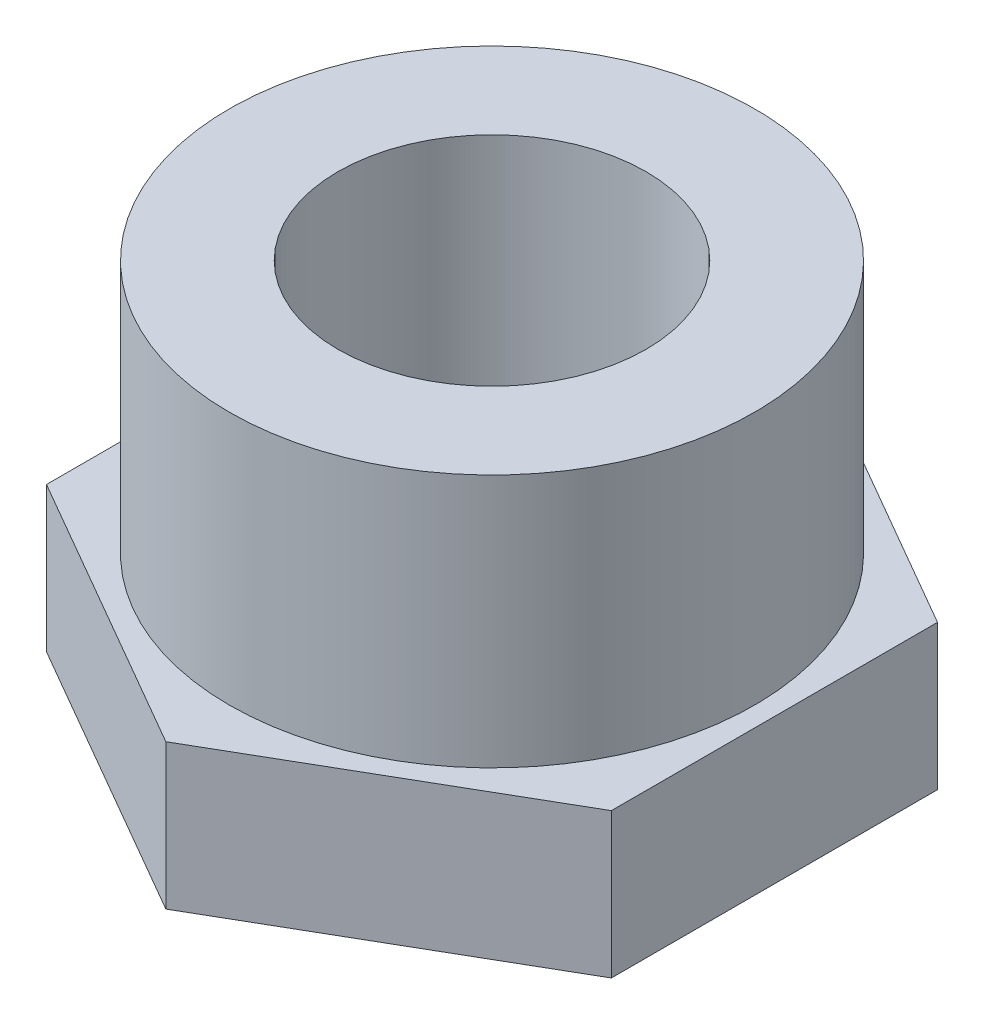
ISO-10303-21;
HEADER;
FILE_DESCRIPTION(('STEP AP214'),'2;1');
FILE_NAME('part.step','',(''),(''),'','','');
FILE_SCHEMA(('AUTOMOTIVE_DESIGN { 1 0 10303 214 1 1 1 1 }'));
ENDSEC;
DATA;
#1=APPLICATION_CONTEXT('core data for automotive mechanical design processes');
#2=APPLICATION_PROTOCOL_DEFINITION('international standard','automotive_design',2000,#1);
#3=PRODUCT_CONTEXT('',#1,'mechanical');
#4=PRODUCT('Part','Part','',(#3));
#5=PRODUCT_RELATED_PRODUCT_CATEGORY('part','',(#4));
#6=PRODUCT_DEFINITION_FORMATION('','',#4);
#7=PRODUCT_DEFINITION_CONTEXT('part definition',#1,'design');
#8=PRODUCT_DEFINITION('design','',#6,#7);
#9=PRODUCT_DEFINITION_SHAPE('','',#8);
#10=(LENGTH_UNIT() NAMED_UNIT(*) SI_UNIT(.MILLI.,.METRE.));
#11=(NAMED_UNIT(*) PLANE_ANGLE_UNIT() SI_UNIT($,.RADIAN.));
#12=(NAMED_UNIT(*) SI_UNIT($,.STERADIAN.) SOLID_ANGLE_UNIT());
#13=UNCERTAINTY_MEASURE_WITH_UNIT(LENGTH_MEASURE(1.E-05),#10,'distance_accuracy_value','');
#14=(GEOMETRIC_REPRESENTATION_CONTEXT(3) GLOBAL_UNCERTAINTY_ASSIGNED_CONTEXT((#13)) GLOBAL_UNIT_ASSIGNED_CONTEXT((#10,
#11,#12)) REPRESENTATION_CONTEXT('',''));
#15=CARTESIAN_POINT('',(0.,0.,0.));
#16=DIRECTION('',(0.,0.,1.));
#17=DIRECTION('',(1.,0.,0.));
#18=AXIS2_PLACEMENT_3D('',#15,#16,#17);
#19=CARTESIAN_POINT('',(0.,10.16,0.));
#20=DIRECTION('',(0.,1.,0.));
#21=DIRECTION('',(0.,0.,1.));
#22=AXIS2_PLACEMENT_3D('',#19,#20,#21);
#23=PLANE('',#22);
#24=CARTESIAN_POINT('',(0.,10.16,0.));
#25=DIRECTION('',(0.,1.,0.));
#26=DIRECTION('',(0.,0.,1.));
#27=AXIS2_PLACEMENT_3D('',#24,#25,#26);
#28=CIRCLE('',#27,18.415);
#29=CARTESIAN_POINT('',(0.,10.16,18.415));
#30=VERTEX_POINT('',#29);
#31=EDGE_CURVE('E11',#30,#30,#28,.T.);
#32=ORIENTED_EDGE('',*,*,#31,.F.);
#33=EDGE_LOOP('',(#32));
#34=FACE_BOUND('',#33,.T.);
#35=DIRECTION('',(-0.866025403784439,0.,-0.5));
#36=VECTOR('',#35,1.);
#37=CARTESIAN_POINT('',(19.7973407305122,10.16,-11.43));
#38=LINE('',#37,#36);
#39=CARTESIAN_POINT('',(19.7973407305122,10.16,-11.43));
#40=VERTEX_POINT('',#39);
#41=CARTESIAN_POINT('',(0.,10.16,-22.86));
#42=VERTEX_POINT('',#41);
#43=EDGE_CURVE('E161',#40,#42,#38,.T.);
#44=ORIENTED_EDGE('',*,*,#43,.T.);
#45=DIRECTION('',(-0.866025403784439,0.,0.5));
#46=VECTOR('',#45,1.);
#47=CARTESIAN_POINT('',(0.,10.16,-22.86));
#48=LINE('',#47,#46);
#49=CARTESIAN_POINT('',(-19.7973407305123,10.16,-11.43));
#50=VERTEX_POINT('',#49);
#51=EDGE_CURVE('E110',#42,#50,#48,.T.);
#52=ORIENTED_EDGE('',*,*,#51,.T.);
#53=DIRECTION('',(0.,0.,1.));
#54=VECTOR('',#53,1.);
#55=CARTESIAN_POINT('',(-19.7973407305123,10.16,-11.43));
#56=LINE('',#55,#54);
#57=CARTESIAN_POINT('',(-19.7973407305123,10.16,11.43));
#58=VERTEX_POINT('',#57);
#59=EDGE_CURVE('E122',#50,#58,#56,.T.);
#60=ORIENTED_EDGE('',*,*,#59,.T.);
#61=DIRECTION('',(0.866025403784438,0.,0.5));
#62=VECTOR('',#61,1.);
#63=CARTESIAN_POINT('',(-19.7973407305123,10.16,11.43));
#64=LINE('',#63,#62);
#65=CARTESIAN_POINT('',(0.,10.16,22.86));
#66=VERTEX_POINT('',#65);
#67=EDGE_CURVE('E117',#58,#66,#64,.T.);
#68=ORIENTED_EDGE('',*,*,#67,.T.);
#69=DIRECTION('',(0.866025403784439,0.,-0.5));
#70=VECTOR('',#69,1.);
#71=CARTESIAN_POINT('',(0.,10.16,22.86));
#72=LINE('',#71,#70);
#73=CARTESIAN_POINT('',(19.7973407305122,10.16,11.43));
#74=VERTEX_POINT('',#73);
#75=EDGE_CURVE('E120',#66,#74,#72,.T.);
#76=ORIENTED_EDGE('',*,*,#75,.T.);
#77=DIRECTION('',(0.,0.,-1.));
#78=VECTOR('',#77,1.);
#79=CARTESIAN_POINT('',(19.7973407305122,10.16,11.43));
#80=LINE('',#79,#78);
#81=EDGE_CURVE('E72',#74,#40,#80,.T.);
#82=ORIENTED_EDGE('',*,*,#81,.T.);
#83=EDGE_LOOP('',(#44,#52,#60,#68,#76,#82));
#84=FACE_BOUND('',#83,.T.);
#85=ADVANCED_FACE('F53',(#34,#84),#23,.T.);
#86=CARTESIAN_POINT('',(0.,0.,0.));
#87=DIRECTION('',(0.,1.,0.));
#88=DIRECTION('',(0.,0.,1.));
#89=AXIS2_PLACEMENT_3D('',#86,#87,#88);
#90=PLANE('',#89);
#91=DIRECTION('',(-0.866025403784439,0.,-0.5));
#92=VECTOR('',#91,1.);
#93=CARTESIAN_POINT('',(19.7973407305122,0.,-11.43));
#94=LINE('',#93,#92);
#95=CARTESIAN_POINT('',(19.7973407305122,0.,-11.43));
#96=VERTEX_POINT('',#95);
#97=CARTESIAN_POINT('',(0.,0.,-22.86));
#98=VERTEX_POINT('',#97);
#99=EDGE_CURVE('E144',#96,#98,#94,.T.);
#100=ORIENTED_EDGE('',*,*,#99,.F.);
#101=DIRECTION('',(0.,0.,-1.));
#102=VECTOR('',#101,1.);
#103=CARTESIAN_POINT('',(19.7973407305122,0.,11.43));
#104=LINE('',#103,#102);
#105=CARTESIAN_POINT('',(19.7973407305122,0.,11.43));
#106=VERTEX_POINT('',#105);
#107=EDGE_CURVE('E101',#106,#96,#104,.T.);
#108=ORIENTED_EDGE('',*,*,#107,.F.);
#109=DIRECTION('',(0.866025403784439,0.,-0.5));
#110=VECTOR('',#109,1.);
#111=CARTESIAN_POINT('',(0.,0.,22.86));
#112=LINE('',#111,#110);
#113=CARTESIAN_POINT('',(0.,0.,22.86));
#114=VERTEX_POINT('',#113);
#115=EDGE_CURVE('E95',#114,#106,#112,.T.);
#116=ORIENTED_EDGE('',*,*,#115,.F.);
#117=DIRECTION('',(0.866025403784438,0.,0.5));
#118=VECTOR('',#117,1.);
#119=CARTESIAN_POINT('',(-19.7973407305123,0.,11.43));
#120=LINE('',#119,#118);
#121=CARTESIAN_POINT('',(-19.7973407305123,0.,11.43));
#122=VERTEX_POINT('',#121);
#123=EDGE_CURVE('E131',#122,#114,#120,.T.);
#124=ORIENTED_EDGE('',*,*,#123,.F.);
#125=DIRECTION('',(0.,0.,1.));
#126=VECTOR('',#125,1.);
#127=CARTESIAN_POINT('',(-19.7973407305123,0.,-11.43));
#128=LINE('',#127,#126);
#129=CARTESIAN_POINT('',(-19.7973407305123,0.,-11.43));
#130=VERTEX_POINT('',#129);
#131=EDGE_CURVE('E152',#130,#122,#128,.T.);
#132=ORIENTED_EDGE('',*,*,#131,.F.);
#133=DIRECTION('',(-0.866025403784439,0.,0.5));
#134=VECTOR('',#133,1.);
#135=CARTESIAN_POINT('',(0.,0.,-22.86));
#136=LINE('',#135,#134);
#137=EDGE_CURVE('E148',#98,#130,#136,.T.);
#138=ORIENTED_EDGE('',*,*,#137,.F.);
#139=EDGE_LOOP('',(#100,#108,#116,#124,#132,#138));
#140=FACE_BOUND('',#139,.T.);
#141=CARTESIAN_POINT('',(0.,0.,0.));
#142=DIRECTION('',(0.,1.,0.));
#143=DIRECTION('',(0.,0.,1.));
#144=AXIS2_PLACEMENT_3D('',#141,#142,#143);
#145=CIRCLE('',#144,10.795);
#146=CARTESIAN_POINT('',(0.,0.,10.795));
#147=VERTEX_POINT('',#146);
#148=EDGE_CURVE('E149',#147,#147,#145,.T.);
#149=ORIENTED_EDGE('',*,*,#148,.T.);
#150=EDGE_LOOP('',(#149));
#151=FACE_BOUND('',#150,.T.);
#152=ADVANCED_FACE('F179',(#140,#151),#90,.F.);
#153=CARTESIAN_POINT('',(19.7973407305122,10.16,-11.43));
#154=DIRECTION('',(-0.5,0.,0.866025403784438));
#155=DIRECTION('',(0.866025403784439,0.,0.5));
#156=AXIS2_PLACEMENT_3D('',#153,#154,#155);
#157=PLANE('',#156);
#158=ORIENTED_EDGE('',*,*,#99,.T.);
#159=DIRECTION('',(0.,-1.,0.));
#160=VECTOR('',#159,1.);
#161=CARTESIAN_POINT('',(0.,10.16,-22.86));
#162=LINE('',#161,#160);
#163=EDGE_CURVE('E57',#42,#98,#162,.T.);
#164=ORIENTED_EDGE('',*,*,#163,.F.);
#165=ORIENTED_EDGE('',*,*,#43,.F.);
#166=DIRECTION('',(0.,-1.,0.));
#167=VECTOR('',#166,1.);
#168=CARTESIAN_POINT('',(19.7973407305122,10.16,-11.43));
#169=LINE('',#168,#167);
#170=EDGE_CURVE('E140',#40,#96,#169,.T.);
#171=ORIENTED_EDGE('',*,*,#170,.T.);
#172=EDGE_LOOP('',(#158,#164,#165,#171));
#173=FACE_BOUND('',#172,.T.);
#174=ADVANCED_FACE('F55',(#173),#157,.F.);
#175=CARTESIAN_POINT('',(0.,10.16,-22.86));
#176=DIRECTION('',(0.5,0.,0.866025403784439));
#177=DIRECTION('',(0.866025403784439,0.,-0.5));
#178=AXIS2_PLACEMENT_3D('',#175,#176,#177);
#179=PLANE('',#178);
#180=ORIENTED_EDGE('',*,*,#137,.T.);
#181=DIRECTION('',(0.,-1.,0.));
#182=VECTOR('',#181,1.);
#183=CARTESIAN_POINT('',(-19.7973407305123,10.16,-11.43));
#184=LINE('',#183,#182);
#185=EDGE_CURVE('E167',#50,#130,#184,.T.);
#186=ORIENTED_EDGE('',*,*,#185,.F.);
#187=ORIENTED_EDGE('',*,*,#51,.F.);
#188=ORIENTED_EDGE('',*,*,#163,.T.);
#189=EDGE_LOOP('',(#180,#186,#187,#188));
#190=FACE_BOUND('',#189,.T.);
#191=ADVANCED_FACE('F174',(#190),#179,.F.);
#192=CARTESIAN_POINT('',(-19.7973407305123,10.16,-11.43));
#193=DIRECTION('',(1.,0.,0.));
#194=DIRECTION('',(0.,0.,-1.));
#195=AXIS2_PLACEMENT_3D('',#192,#193,#194);
#196=PLANE('',#195);
#197=ORIENTED_EDGE('',*,*,#131,.T.);
#198=DIRECTION('',(0.,-1.,0.));
#199=VECTOR('',#198,1.);
#200=CARTESIAN_POINT('',(-19.7973407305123,10.16,11.43));
#201=LINE('',#200,#199);
#202=EDGE_CURVE('E133',#58,#122,#201,.T.);
#203=ORIENTED_EDGE('',*,*,#202,.F.);
#204=ORIENTED_EDGE('',*,*,#59,.F.);
#205=ORIENTED_EDGE('',*,*,#185,.T.);
#206=EDGE_LOOP('',(#197,#203,#204,#205));
#207=FACE_BOUND('',#206,.T.);
#208=ADVANCED_FACE('F181',(#207),#196,.F.);
#209=CARTESIAN_POINT('',(-19.7973407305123,10.16,11.43));
#210=DIRECTION('',(0.5,0.,-0.866025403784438));
#211=DIRECTION('',(-0.866025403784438,0.,-0.5));
#212=AXIS2_PLACEMENT_3D('',#209,#210,#211);
#213=PLANE('',#212);
#214=ORIENTED_EDGE('',*,*,#123,.T.);
#215=DIRECTION('',(0.,-1.,0.));
#216=VECTOR('',#215,1.);
#217=CARTESIAN_POINT('',(0.,10.16,22.86));
#218=LINE('',#217,#216);
#219=EDGE_CURVE('E128',#66,#114,#218,.T.);
#220=ORIENTED_EDGE('',*,*,#219,.F.);
#221=ORIENTED_EDGE('',*,*,#67,.F.);
#222=ORIENTED_EDGE('',*,*,#202,.T.);
#223=EDGE_LOOP('',(#214,#220,#221,#222));
#224=FACE_BOUND('',#223,.T.);
#225=ADVANCED_FACE('F129',(#224),#213,.F.);
#226=CARTESIAN_POINT('',(0.,10.16,22.86));
#227=DIRECTION('',(-0.5,0.,-0.866025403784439));
#228=DIRECTION('',(-0.866025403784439,0.,0.5));
#229=AXIS2_PLACEMENT_3D('',#226,#227,#228);
#230=PLANE('',#229);
#231=ORIENTED_EDGE('',*,*,#115,.T.);
#232=DIRECTION('',(0.,-1.,0.));
#233=VECTOR('',#232,1.);
#234=CARTESIAN_POINT('',(19.7973407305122,10.16,11.43));
#235=LINE('',#234,#233);
#236=EDGE_CURVE('E134',#74,#106,#235,.T.);
#237=ORIENTED_EDGE('',*,*,#236,.F.);
#238=ORIENTED_EDGE('',*,*,#75,.F.);
#239=ORIENTED_EDGE('',*,*,#219,.T.);
#240=EDGE_LOOP('',(#231,#237,#238,#239));
#241=FACE_BOUND('',#240,.T.);
#242=ADVANCED_FACE('F136',(#241),#230,.F.);
#243=CARTESIAN_POINT('',(19.7973407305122,10.16,11.43));
#244=DIRECTION('',(-1.,0.,0.));
#245=DIRECTION('',(0.,0.,1.));
#246=AXIS2_PLACEMENT_3D('',#243,#244,#245);
#247=PLANE('',#246);
#248=ORIENTED_EDGE('',*,*,#107,.T.);
#249=ORIENTED_EDGE('',*,*,#170,.F.);
#250=ORIENTED_EDGE('',*,*,#81,.F.);
#251=ORIENTED_EDGE('',*,*,#236,.T.);
#252=EDGE_LOOP('',(#248,#249,#250,#251));
#253=FACE_BOUND('',#252,.T.);
#254=ADVANCED_FACE('F215',(#253),#247,.F.);
#255=CARTESIAN_POINT('',(0.,10.16,0.));
#256=DIRECTION('',(0.,-1.,0.));
#257=DIRECTION('',(0.,0.,-1.));
#258=AXIS2_PLACEMENT_3D('',#255,#256,#257);
#259=CYLINDRICAL_SURFACE('',#258,10.795);
#260=ORIENTED_EDGE('',*,*,#148,.F.);
#261=EDGE_LOOP('',(#260));
#262=FACE_BOUND('',#261,.T.);
#263=CARTESIAN_POINT('',(0.,27.94,0.));
#264=DIRECTION('',(0.,1.,0.));
#265=DIRECTION('',(0.,0.,1.));
#266=AXIS2_PLACEMENT_3D('',#263,#264,#265);
#267=CIRCLE('',#266,10.795);
#268=CARTESIAN_POINT('',(0.,27.94,10.795));
#269=VERTEX_POINT('',#268);
#270=EDGE_CURVE('E195',#269,#269,#267,.T.);
#271=ORIENTED_EDGE('',*,*,#270,.T.);
#272=EDGE_LOOP('',(#271));
#273=FACE_BOUND('',#272,.T.);
#274=ADVANCED_FACE('F200',(#262,#273),#259,.F.);
#275=CARTESIAN_POINT('',(0.,27.94,0.));
#276=DIRECTION('',(0.,1.,0.));
#277=DIRECTION('',(0.,0.,1.));
#278=AXIS2_PLACEMENT_3D('',#275,#276,#277);
#279=PLANE('',#278);
#280=CARTESIAN_POINT('',(0.,27.94,0.));
#281=DIRECTION('',(0.,1.,0.));
#282=DIRECTION('',(0.,0.,1.));
#283=AXIS2_PLACEMENT_3D('',#280,#281,#282);
#284=CIRCLE('',#283,18.415);
#285=CARTESIAN_POINT('',(0.,27.94,18.415));
#286=VERTEX_POINT('',#285);
#287=EDGE_CURVE('E190',#286,#286,#284,.T.);
#288=ORIENTED_EDGE('',*,*,#287,.T.);
#289=EDGE_LOOP('',(#288));
#290=FACE_BOUND('',#289,.T.);
#291=ORIENTED_EDGE('',*,*,#270,.F.);
#292=EDGE_LOOP('',(#291));
#293=FACE_BOUND('',#292,.T.);
#294=ADVANCED_FACE('F202',(#290,#293),#279,.T.);
#295=CARTESIAN_POINT('',(0.,27.94,0.));
#296=DIRECTION('',(0.,-1.,0.));
#297=DIRECTION('',(0.,0.,-1.));
#298=AXIS2_PLACEMENT_3D('',#295,#296,#297);
#299=CYLINDRICAL_SURFACE('',#298,18.415);
#300=ORIENTED_EDGE('',*,*,#287,.F.);
#301=EDGE_LOOP('',(#300));
#302=FACE_BOUND('',#301,.T.);
#303=ORIENTED_EDGE('',*,*,#31,.T.);
#304=EDGE_LOOP('',(#303));
#305=FACE_BOUND('',#304,.T.);
#306=ADVANCED_FACE('F204',(#302,#305),#299,.T.);
#307=CLOSED_SHELL('',(#85,#152,#174,#191,#208,#225,#242,#254,#274,#294,#306));
#308=MANIFOLD_SOLID_BREP('B2',#307);
#309=ADVANCED_BREP_SHAPE_REPRESENTATION('',(#18,#308),#14);
#310=SHAPE_DEFINITION_REPRESENTATION(#9,#309);
ENDSEC;
END-ISO-10303-21;
